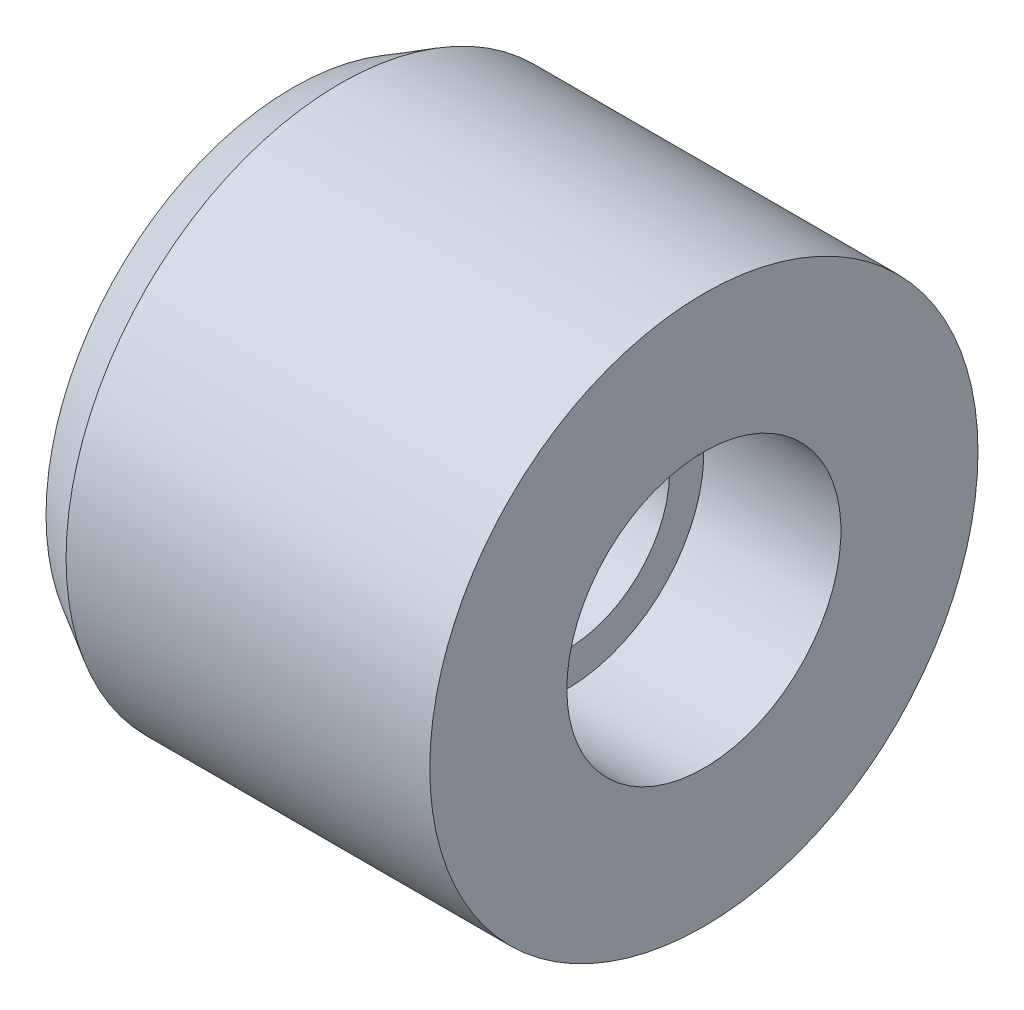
ISO-10303-21;
HEADER;
FILE_DESCRIPTION(('STEP AP214'),'2;1');
FILE_NAME('part.step','',(''),(''),'','','');
FILE_SCHEMA(('AUTOMOTIVE_DESIGN { 1 0 10303 214 1 1 1 1 }'));
ENDSEC;
DATA;
#1=APPLICATION_CONTEXT('core data for automotive mechanical design processes');
#2=APPLICATION_PROTOCOL_DEFINITION('international standard','automotive_design',2000,#1);
#3=PRODUCT_CONTEXT('',#1,'mechanical');
#4=PRODUCT('Part','Part','',(#3));
#5=PRODUCT_RELATED_PRODUCT_CATEGORY('part','',(#4));
#6=PRODUCT_DEFINITION_FORMATION('','',#4);
#7=PRODUCT_DEFINITION_CONTEXT('part definition',#1,'design');
#8=PRODUCT_DEFINITION('design','',#6,#7);
#9=PRODUCT_DEFINITION_SHAPE('','',#8);
#10=(LENGTH_UNIT() NAMED_UNIT(*) SI_UNIT(.MILLI.,.METRE.));
#11=(NAMED_UNIT(*) PLANE_ANGLE_UNIT() SI_UNIT($,.RADIAN.));
#12=(NAMED_UNIT(*) SI_UNIT($,.STERADIAN.) SOLID_ANGLE_UNIT());
#13=UNCERTAINTY_MEASURE_WITH_UNIT(LENGTH_MEASURE(1.E-05),#10,'distance_accuracy_value','');
#14=(GEOMETRIC_REPRESENTATION_CONTEXT(3) GLOBAL_UNCERTAINTY_ASSIGNED_CONTEXT((#13)) GLOBAL_UNIT_ASSIGNED_CONTEXT((#10,
#11,#12)) REPRESENTATION_CONTEXT('',''));
#15=CARTESIAN_POINT('',(0.,0.,0.));
#16=DIRECTION('',(0.,0.,1.));
#17=DIRECTION('',(1.,0.,0.));
#18=AXIS2_PLACEMENT_3D('',#15,#16,#17);
#19=CARTESIAN_POINT('',(0.,0.,0.));
#20=DIRECTION('',(1.,0.,0.));
#21=DIRECTION('',(0.,0.,-1.));
#22=AXIS2_PLACEMENT_3D('',#19,#20,#21);
#23=PLANE('',#22);
#24=CARTESIAN_POINT('',(0.,0.,0.));
#25=DIRECTION('',(-1.,0.,0.));
#26=DIRECTION('',(0.,0.,1.));
#27=AXIS2_PLACEMENT_3D('',#24,#25,#26);
#28=CIRCLE('',#27,3.6);
#29=CARTESIAN_POINT('',(0.,0.,3.6));
#30=VERTEX_POINT('',#29);
#31=EDGE_CURVE('E10',#30,#30,#28,.T.);
#32=ORIENTED_EDGE('',*,*,#31,.T.);
#33=EDGE_LOOP('',(#32));
#34=FACE_BOUND('',#33,.T.);
#35=ADVANCED_FACE('F31',(#34),#23,.F.);
#36=CARTESIAN_POINT('',(0.692820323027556,0.,0.));
#37=DIRECTION('',(1.,0.,0.));
#38=DIRECTION('',(0.,0.,-1.));
#39=AXIS2_PLACEMENT_3D('',#36,#37,#38);
#40=CONICAL_SURFACE('',#39,4.,0.523598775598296);
#41=ORIENTED_EDGE('',*,*,#31,.F.);
#42=EDGE_LOOP('',(#41));
#43=FACE_BOUND('',#42,.T.);
#44=CARTESIAN_POINT('',(0.692820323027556,0.,0.));
#45=DIRECTION('',(-1.,0.,0.));
#46=DIRECTION('',(0.,0.,1.));
#47=AXIS2_PLACEMENT_3D('',#44,#45,#46);
#48=CIRCLE('',#47,4.);
#49=CARTESIAN_POINT('',(0.692820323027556,0.,4.));
#50=VERTEX_POINT('',#49);
#51=EDGE_CURVE('E37',#50,#50,#48,.T.);
#52=ORIENTED_EDGE('',*,*,#51,.T.);
#53=EDGE_LOOP('',(#52));
#54=FACE_BOUND('',#53,.T.);
#55=ADVANCED_FACE('F78',(#43,#54),#40,.T.);
#56=CARTESIAN_POINT('',(-17.9481806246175,0.,0.));
#57=DIRECTION('',(-1.,0.,0.));
#58=DIRECTION('',(0.,0.,1.));
#59=AXIS2_PLACEMENT_3D('',#56,#57,#58);
#60=CYLINDRICAL_SURFACE('',#59,4.);
#61=ORIENTED_EDGE('',*,*,#51,.F.);
#62=EDGE_LOOP('',(#61));
#63=FACE_BOUND('',#62,.T.);
#64=CARTESIAN_POINT('',(6.,0.,0.));
#65=DIRECTION('',(-1.,0.,0.));
#66=DIRECTION('',(0.,0.,1.));
#67=AXIS2_PLACEMENT_3D('',#64,#65,#66);
#68=CIRCLE('',#67,4.);
#69=CARTESIAN_POINT('',(6.,0.,4.));
#70=VERTEX_POINT('',#69);
#71=EDGE_CURVE('E41',#70,#70,#68,.T.);
#72=ORIENTED_EDGE('',*,*,#71,.T.);
#73=EDGE_LOOP('',(#72));
#74=FACE_BOUND('',#73,.T.);
#75=ADVANCED_FACE('F82',(#63,#74),#60,.T.);
#76=CARTESIAN_POINT('',(6.,4.,0.));
#77=DIRECTION('',(-1.,0.,0.));
#78=DIRECTION('',(0.,0.,1.));
#79=AXIS2_PLACEMENT_3D('',#76,#77,#78);
#80=PLANE('',#79);
#81=ORIENTED_EDGE('',*,*,#71,.F.);
#82=EDGE_LOOP('',(#81));
#83=FACE_BOUND('',#82,.T.);
#84=CARTESIAN_POINT('',(6.,0.,0.));
#85=DIRECTION('',(-1.,0.,0.));
#86=DIRECTION('',(0.,0.,1.));
#87=AXIS2_PLACEMENT_3D('',#84,#85,#86);
#88=CIRCLE('',#87,2.);
#89=CARTESIAN_POINT('',(6.,0.,2.));
#90=VERTEX_POINT('',#89);
#91=EDGE_CURVE('E45',#90,#90,#88,.T.);
#92=ORIENTED_EDGE('',*,*,#91,.T.);
#93=EDGE_LOOP('',(#92));
#94=FACE_BOUND('',#93,.T.);
#95=ADVANCED_FACE('F87',(#83,#94),#80,.F.);
#96=CARTESIAN_POINT('',(-17.9481806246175,0.,0.));
#97=DIRECTION('',(-1.,0.,0.));
#98=DIRECTION('',(0.,0.,1.));
#99=AXIS2_PLACEMENT_3D('',#96,#97,#98);
#100=CYLINDRICAL_SURFACE('',#99,2.);
#101=ORIENTED_EDGE('',*,*,#91,.F.);
#102=EDGE_LOOP('',(#101));
#103=FACE_BOUND('',#102,.T.);
#104=CARTESIAN_POINT('',(4.,0.,0.));
#105=DIRECTION('',(-1.,0.,0.));
#106=DIRECTION('',(0.,0.,1.));
#107=AXIS2_PLACEMENT_3D('',#104,#105,#106);
#108=CIRCLE('',#107,2.);
#109=CARTESIAN_POINT('',(4.,0.,2.));
#110=VERTEX_POINT('',#109);
#111=EDGE_CURVE('E50',#110,#110,#108,.T.);
#112=ORIENTED_EDGE('',*,*,#111,.T.);
#113=EDGE_LOOP('',(#112));
#114=FACE_BOUND('',#113,.T.);
#115=ADVANCED_FACE('F93',(#103,#114),#100,.F.);
#116=CARTESIAN_POINT('',(4.,2.,0.));
#117=DIRECTION('',(-1.,0.,0.));
#118=DIRECTION('',(0.,0.,1.));
#119=AXIS2_PLACEMENT_3D('',#116,#117,#118);
#120=PLANE('',#119);
#121=ORIENTED_EDGE('',*,*,#111,.F.);
#122=EDGE_LOOP('',(#121));
#123=FACE_BOUND('',#122,.T.);
#124=CARTESIAN_POINT('',(4.,0.,0.));
#125=DIRECTION('',(-1.,0.,0.));
#126=DIRECTION('',(0.,0.,1.));
#127=AXIS2_PLACEMENT_3D('',#124,#125,#126);
#128=CIRCLE('',#127,1.5);
#129=CARTESIAN_POINT('',(4.,0.,1.5));
#130=VERTEX_POINT('',#129);
#131=EDGE_CURVE('E53',#130,#130,#128,.T.);
#132=ORIENTED_EDGE('',*,*,#131,.T.);
#133=EDGE_LOOP('',(#132));
#134=FACE_BOUND('',#133,.T.);
#135=ADVANCED_FACE('F97',(#123,#134),#120,.F.);
#136=CARTESIAN_POINT('',(-17.9481806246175,0.,0.));
#137=DIRECTION('',(-1.,0.,0.));
#138=DIRECTION('',(0.,0.,1.));
#139=AXIS2_PLACEMENT_3D('',#136,#137,#138);
#140=CYLINDRICAL_SURFACE('',#139,1.5);
#141=ORIENTED_EDGE('',*,*,#131,.F.);
#142=EDGE_LOOP('',(#141));
#143=FACE_BOUND('',#142,.T.);
#144=CARTESIAN_POINT('',(3.,0.,0.));
#145=DIRECTION('',(-1.,0.,0.));
#146=DIRECTION('',(0.,0.,1.));
#147=AXIS2_PLACEMENT_3D('',#144,#145,#146);
#148=CIRCLE('',#147,1.5);
#149=CARTESIAN_POINT('',(3.,0.,1.5));
#150=VERTEX_POINT('',#149);
#151=EDGE_CURVE('E56',#150,#150,#148,.T.);
#152=ORIENTED_EDGE('',*,*,#151,.T.);
#153=EDGE_LOOP('',(#152));
#154=FACE_BOUND('',#153,.T.);
#155=ADVANCED_FACE('F101',(#143,#154),#140,.F.);
#156=CARTESIAN_POINT('',(3.,1.5,0.));
#157=DIRECTION('',(1.,0.,0.));
#158=DIRECTION('',(0.,0.,-1.));
#159=AXIS2_PLACEMENT_3D('',#156,#157,#158);
#160=PLANE('',#159);
#161=ORIENTED_EDGE('',*,*,#151,.F.);
#162=EDGE_LOOP('',(#161));
#163=FACE_BOUND('',#162,.T.);
#164=CARTESIAN_POINT('',(3.,0.,0.));
#165=DIRECTION('',(-1.,0.,0.));
#166=DIRECTION('',(0.,0.,1.));
#167=AXIS2_PLACEMENT_3D('',#164,#165,#166);
#168=CIRCLE('',#167,2.);
#169=CARTESIAN_POINT('',(3.,0.,2.));
#170=VERTEX_POINT('',#169);
#171=EDGE_CURVE('E59',#170,#170,#168,.T.);
#172=ORIENTED_EDGE('',*,*,#171,.T.);
#173=EDGE_LOOP('',(#172));
#174=FACE_BOUND('',#173,.T.);
#175=ADVANCED_FACE('F74',(#163,#174),#160,.F.);
#176=CARTESIAN_POINT('',(-17.9481806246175,0.,0.));
#177=DIRECTION('',(-1.,0.,0.));
#178=DIRECTION('',(0.,0.,1.));
#179=AXIS2_PLACEMENT_3D('',#176,#177,#178);
#180=CYLINDRICAL_SURFACE('',#179,2.);
#181=ORIENTED_EDGE('',*,*,#171,.F.);
#182=EDGE_LOOP('',(#181));
#183=FACE_BOUND('',#182,.T.);
#184=CARTESIAN_POINT('',(1.,0.,0.));
#185=DIRECTION('',(-1.,0.,0.));
#186=DIRECTION('',(0.,0.,1.));
#187=AXIS2_PLACEMENT_3D('',#184,#185,#186);
#188=CIRCLE('',#187,2.);
#189=CARTESIAN_POINT('',(1.,0.,2.));
#190=VERTEX_POINT('',#189);
#191=EDGE_CURVE('E62',#190,#190,#188,.T.);
#192=ORIENTED_EDGE('',*,*,#191,.T.);
#193=EDGE_LOOP('',(#192));
#194=FACE_BOUND('',#193,.T.);
#195=ADVANCED_FACE('F66',(#183,#194),#180,.F.);
#196=CARTESIAN_POINT('',(1.,2.,0.));
#197=DIRECTION('',(-1.,0.,0.));
#198=DIRECTION('',(0.,0.,1.));
#199=AXIS2_PLACEMENT_3D('',#196,#197,#198);
#200=PLANE('',#199);
#201=ORIENTED_EDGE('',*,*,#191,.F.);
#202=EDGE_LOOP('',(#201));
#203=FACE_BOUND('',#202,.T.);
#204=ADVANCED_FACE('F68',(#203),#200,.F.);
#205=CLOSED_SHELL('',(#35,#55,#75,#95,#115,#135,#155,#175,#195,#204));
#206=MANIFOLD_SOLID_BREP('B2',#205);
#207=ADVANCED_BREP_SHAPE_REPRESENTATION('',(#18,#206),#14);
#208=SHAPE_DEFINITION_REPRESENTATION(#9,#207);
ENDSEC;
END-ISO-10303-21;
